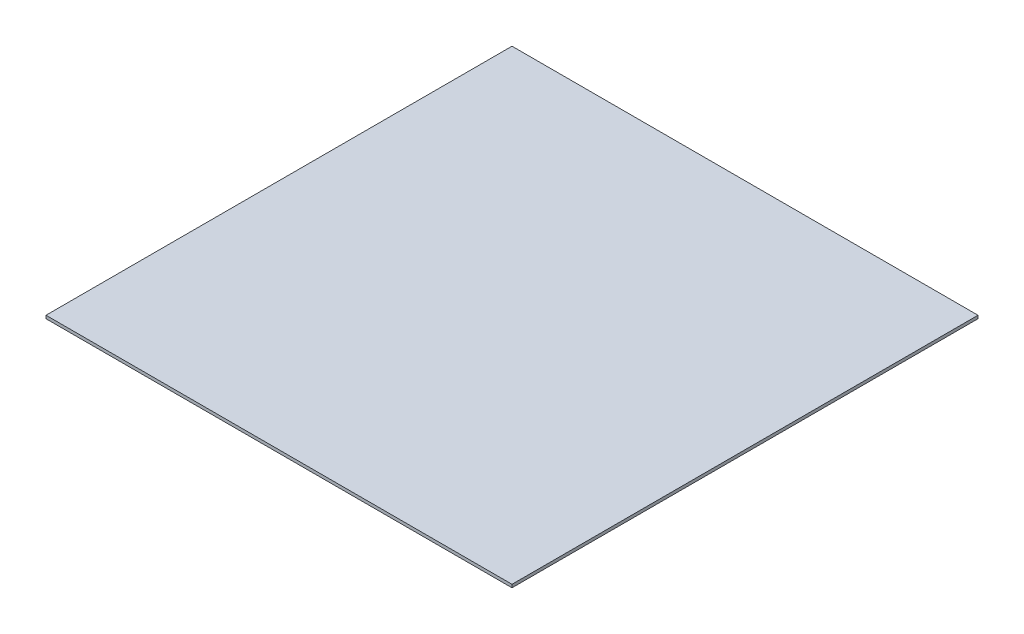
from build123d import *

# Parameters (mm, degrees)
SKETCH1_W           = 609.6
SKETCH1_H           = 609.6
BOSS_EXTRUDE1_DEPTH = 4


with BuildPart() as part:
    # Sketch1 → Boss-Extrude1 (new body)
    with BuildSketch(Plane(origin=(0, 0, 0), x_dir=(1, 0, 0), z_dir=(0, 1, 0))):
        Rectangle(SKETCH1_W, SKETCH1_H)
    extrude(amount=BOSS_EXTRUDE1_DEPTH)


solid = part.part
